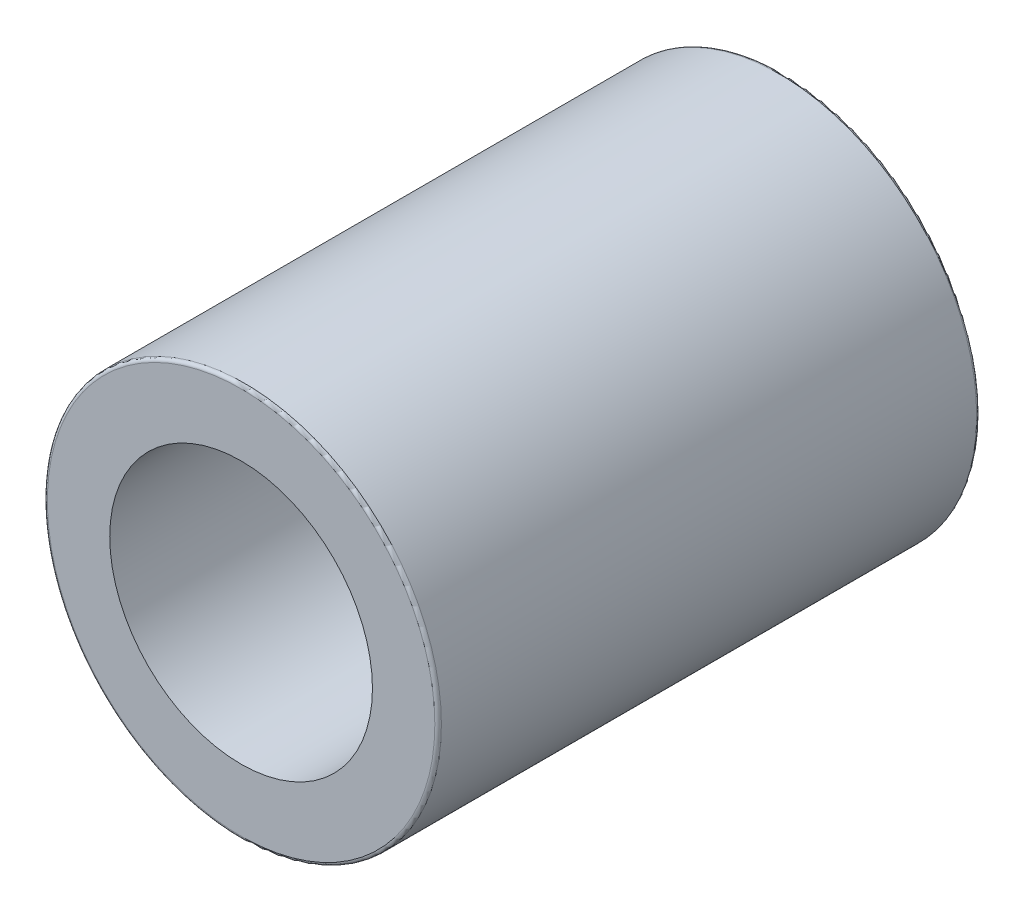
ISO-10303-21;
HEADER;
FILE_DESCRIPTION(('STEP AP214'),'2;1');
FILE_NAME('part.step','',(''),(''),'','','');
FILE_SCHEMA(('AUTOMOTIVE_DESIGN { 1 0 10303 214 1 1 1 1 }'));
ENDSEC;
DATA;
#1=APPLICATION_CONTEXT('core data for automotive mechanical design processes');
#2=APPLICATION_PROTOCOL_DEFINITION('international standard','automotive_design',2000,#1);
#3=PRODUCT_CONTEXT('',#1,'mechanical');
#4=PRODUCT('Part','Part','',(#3));
#5=PRODUCT_RELATED_PRODUCT_CATEGORY('part','',(#4));
#6=PRODUCT_DEFINITION_FORMATION('','',#4);
#7=PRODUCT_DEFINITION_CONTEXT('part definition',#1,'design');
#8=PRODUCT_DEFINITION('design','',#6,#7);
#9=PRODUCT_DEFINITION_SHAPE('','',#8);
#10=(LENGTH_UNIT() NAMED_UNIT(*) SI_UNIT(.MILLI.,.METRE.));
#11=(NAMED_UNIT(*) PLANE_ANGLE_UNIT() SI_UNIT($,.RADIAN.));
#12=(NAMED_UNIT(*) SI_UNIT($,.STERADIAN.) SOLID_ANGLE_UNIT());
#13=UNCERTAINTY_MEASURE_WITH_UNIT(LENGTH_MEASURE(1.E-05),#10,'distance_accuracy_value','');
#14=(GEOMETRIC_REPRESENTATION_CONTEXT(3) GLOBAL_UNCERTAINTY_ASSIGNED_CONTEXT((#13)) GLOBAL_UNIT_ASSIGNED_CONTEXT((#10,
#11,#12)) REPRESENTATION_CONTEXT('',''));
#15=CARTESIAN_POINT('',(0.,0.,0.));
#16=DIRECTION('',(0.,0.,1.));
#17=DIRECTION('',(1.,0.,0.));
#18=AXIS2_PLACEMENT_3D('',#15,#16,#17);
#19=CARTESIAN_POINT('',(0.,0.,165.));
#20=DIRECTION('',(0.,0.,1.));
#21=DIRECTION('',(1.,0.,0.));
#22=AXIS2_PLACEMENT_3D('',#19,#20,#21);
#23=PLANE('',#22);
#24=CARTESIAN_POINT('',(0.,0.,165.));
#25=DIRECTION('',(0.,0.,1.));
#26=DIRECTION('',(1.,0.,0.));
#27=AXIS2_PLACEMENT_3D('',#24,#25,#26);
#28=CIRCLE('',#27,59.);
#29=CARTESIAN_POINT('',(59.,0.,165.));
#30=VERTEX_POINT('',#29);
#31=EDGE_CURVE('E10',#30,#30,#28,.T.);
#32=ORIENTED_EDGE('',*,*,#31,.T.);
#33=EDGE_LOOP('',(#32));
#34=FACE_BOUND('',#33,.T.);
#35=CARTESIAN_POINT('',(0.,0.,165.));
#36=DIRECTION('',(0.,0.,1.));
#37=DIRECTION('',(1.,0.,0.));
#38=AXIS2_PLACEMENT_3D('',#35,#36,#37);
#39=CIRCLE('',#38,40.);
#40=CARTESIAN_POINT('',(40.,0.,165.));
#41=VERTEX_POINT('',#40);
#42=EDGE_CURVE('E67',#41,#41,#39,.T.);
#43=ORIENTED_EDGE('',*,*,#42,.F.);
#44=EDGE_LOOP('',(#43));
#45=FACE_BOUND('',#44,.T.);
#46=ADVANCED_FACE('F43',(#34,#45),#23,.T.);
#47=CARTESIAN_POINT('',(0.,0.,0.));
#48=DIRECTION('',(0.,0.,1.));
#49=DIRECTION('',(1.,0.,0.));
#50=AXIS2_PLACEMENT_3D('',#47,#48,#49);
#51=PLANE('',#50);
#52=CARTESIAN_POINT('',(0.,0.,0.));
#53=DIRECTION('',(0.,0.,1.));
#54=DIRECTION('',(1.,0.,0.));
#55=AXIS2_PLACEMENT_3D('',#52,#53,#54);
#56=CIRCLE('',#55,59.);
#57=CARTESIAN_POINT('',(59.,0.,0.));
#58=VERTEX_POINT('',#57);
#59=EDGE_CURVE('E51',#58,#58,#56,.F.);
#60=ORIENTED_EDGE('',*,*,#59,.T.);
#61=EDGE_LOOP('',(#60));
#62=FACE_BOUND('',#61,.T.);
#63=CARTESIAN_POINT('',(0.,0.,0.));
#64=DIRECTION('',(0.,0.,1.));
#65=DIRECTION('',(1.,0.,0.));
#66=AXIS2_PLACEMENT_3D('',#63,#64,#65);
#67=CIRCLE('',#66,40.);
#68=CARTESIAN_POINT('',(40.,0.,0.));
#69=VERTEX_POINT('',#68);
#70=EDGE_CURVE('E68',#69,#69,#67,.T.);
#71=ORIENTED_EDGE('',*,*,#70,.T.);
#72=EDGE_LOOP('',(#71));
#73=FACE_BOUND('',#72,.T.);
#74=ADVANCED_FACE('F80',(#62,#73),#51,.F.);
#75=CARTESIAN_POINT('',(0.,0.,165.));
#76=DIRECTION('',(0.,0.,-1.));
#77=DIRECTION('',(-1.,0.,0.));
#78=AXIS2_PLACEMENT_3D('',#75,#76,#77);
#79=CYLINDRICAL_SURFACE('',#78,60.);
#80=CARTESIAN_POINT('',(0.,0.,1.));
#81=DIRECTION('',(0.,0.,1.));
#82=DIRECTION('',(1.,0.,0.));
#83=AXIS2_PLACEMENT_3D('',#80,#81,#82);
#84=CIRCLE('',#83,60.);
#85=CARTESIAN_POINT('',(60.,0.,1.));
#86=VERTEX_POINT('',#85);
#87=EDGE_CURVE('E56',#86,#86,#84,.T.);
#88=ORIENTED_EDGE('',*,*,#87,.T.);
#89=EDGE_LOOP('',(#88));
#90=FACE_BOUND('',#89,.T.);
#91=CARTESIAN_POINT('',(0.,0.,164.));
#92=DIRECTION('',(0.,0.,1.));
#93=DIRECTION('',(1.,0.,0.));
#94=AXIS2_PLACEMENT_3D('',#91,#92,#93);
#95=CIRCLE('',#94,60.);
#96=CARTESIAN_POINT('',(60.,0.,164.));
#97=VERTEX_POINT('',#96);
#98=EDGE_CURVE('E61',#97,#97,#95,.F.);
#99=ORIENTED_EDGE('',*,*,#98,.T.);
#100=EDGE_LOOP('',(#99));
#101=FACE_BOUND('',#100,.T.);
#102=ADVANCED_FACE('F85',(#90,#101),#79,.T.);
#103=CARTESIAN_POINT('',(0.,0.,165.));
#104=DIRECTION('',(0.,0.,-1.));
#105=DIRECTION('',(-1.,0.,0.));
#106=AXIS2_PLACEMENT_3D('',#103,#104,#105);
#107=CYLINDRICAL_SURFACE('',#106,40.);
#108=ORIENTED_EDGE('',*,*,#42,.T.);
#109=EDGE_LOOP('',(#108));
#110=FACE_BOUND('',#109,.T.);
#111=ORIENTED_EDGE('',*,*,#70,.F.);
#112=EDGE_LOOP('',(#111));
#113=FACE_BOUND('',#112,.T.);
#114=ADVANCED_FACE('F76',(#110,#113),#107,.F.);
#115=CARTESIAN_POINT('',(0.,0.,1.));
#116=DIRECTION('',(0.,0.,1.));
#117=DIRECTION('',(1.,0.,0.));
#118=AXIS2_PLACEMENT_3D('',#115,#116,#117);
#119=TOROIDAL_SURFACE('',#118,59.,1.);
#120=ORIENTED_EDGE('',*,*,#59,.F.);
#121=EDGE_LOOP('',(#120));
#122=FACE_BOUND('',#121,.T.);
#123=ORIENTED_EDGE('',*,*,#87,.F.);
#124=EDGE_LOOP('',(#123));
#125=FACE_BOUND('',#124,.T.);
#126=ADVANCED_FACE('F91',(#122,#125),#119,.T.);
#127=CARTESIAN_POINT('',(0.,0.,164.));
#128=DIRECTION('',(0.,0.,1.));
#129=DIRECTION('',(1.,0.,0.));
#130=AXIS2_PLACEMENT_3D('',#127,#128,#129);
#131=TOROIDAL_SURFACE('',#130,59.,1.);
#132=ORIENTED_EDGE('',*,*,#98,.F.);
#133=EDGE_LOOP('',(#132));
#134=FACE_BOUND('',#133,.T.);
#135=ORIENTED_EDGE('',*,*,#31,.F.);
#136=EDGE_LOOP('',(#135));
#137=FACE_BOUND('',#136,.T.);
#138=ADVANCED_FACE('F45',(#134,#137),#131,.T.);
#139=CLOSED_SHELL('',(#46,#74,#102,#114,#126,#138));
#140=MANIFOLD_SOLID_BREP('B2',#139);
#141=ADVANCED_BREP_SHAPE_REPRESENTATION('',(#18,#140),#14);
#142=SHAPE_DEFINITION_REPRESENTATION(#9,#141);
ENDSEC;
END-ISO-10303-21;
